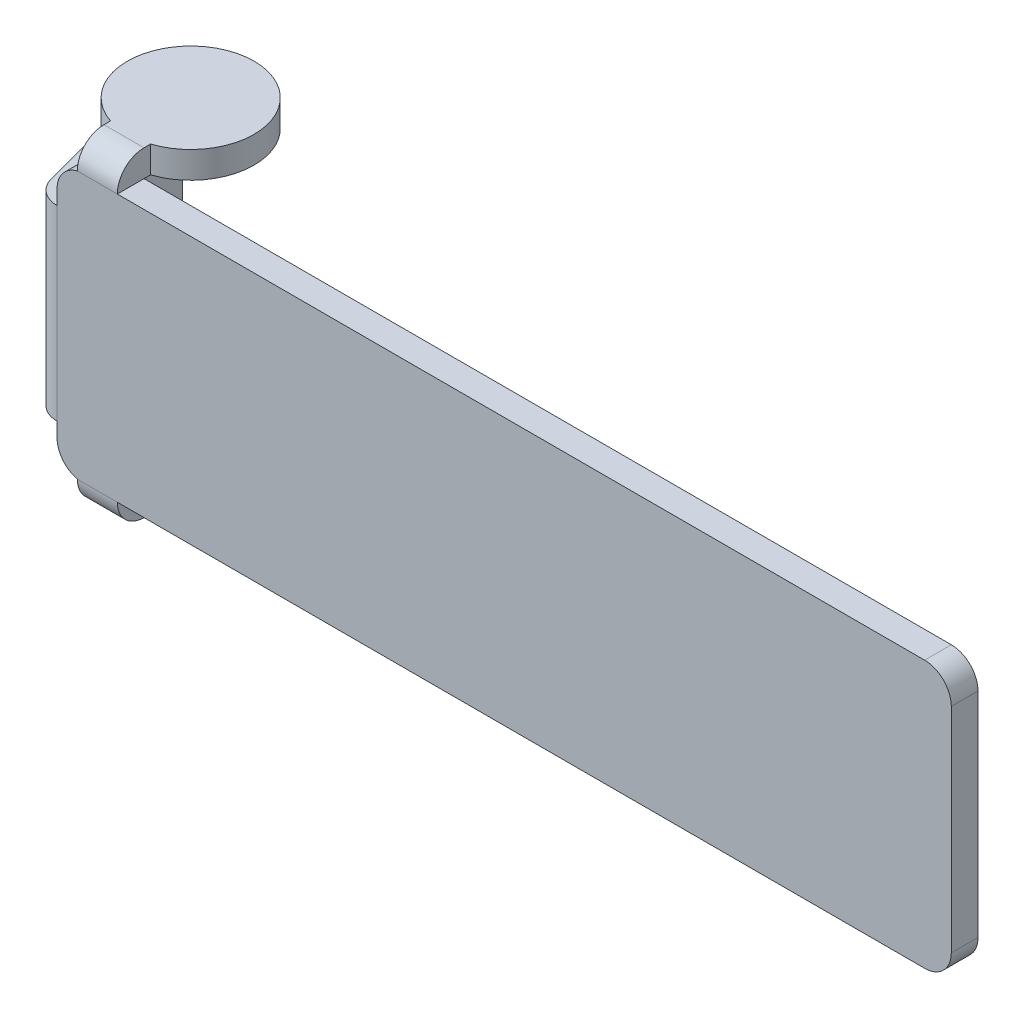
ISO-10303-21;
HEADER;
FILE_DESCRIPTION(('STEP AP214'),'2;1');
FILE_NAME('part.step','',(''),(''),'','','');
FILE_SCHEMA(('AUTOMOTIVE_DESIGN { 1 0 10303 214 1 1 1 1 }'));
ENDSEC;
DATA;
#1=APPLICATION_CONTEXT('core data for automotive mechanical design processes');
#2=APPLICATION_PROTOCOL_DEFINITION('international standard','automotive_design',2000,#1);
#3=PRODUCT_CONTEXT('',#1,'mechanical');
#4=PRODUCT('Part','Part','',(#3));
#5=PRODUCT_RELATED_PRODUCT_CATEGORY('part','',(#4));
#6=PRODUCT_DEFINITION_FORMATION('','',#4);
#7=PRODUCT_DEFINITION_CONTEXT('part definition',#1,'design');
#8=PRODUCT_DEFINITION('design','',#6,#7);
#9=PRODUCT_DEFINITION_SHAPE('','',#8);
#10=(LENGTH_UNIT() NAMED_UNIT(*) SI_UNIT(.MILLI.,.METRE.));
#11=(NAMED_UNIT(*) PLANE_ANGLE_UNIT() SI_UNIT($,.RADIAN.));
#12=(NAMED_UNIT(*) SI_UNIT($,.STERADIAN.) SOLID_ANGLE_UNIT());
#13=UNCERTAINTY_MEASURE_WITH_UNIT(LENGTH_MEASURE(1.E-05),#10,'distance_accuracy_value','');
#14=(GEOMETRIC_REPRESENTATION_CONTEXT(3) GLOBAL_UNCERTAINTY_ASSIGNED_CONTEXT((#13)) GLOBAL_UNIT_ASSIGNED_CONTEXT((#10,
#11,#12)) REPRESENTATION_CONTEXT('',''));
#15=CARTESIAN_POINT('',(0.,0.,0.));
#16=DIRECTION('',(0.,0.,1.));
#17=DIRECTION('',(1.,0.,0.));
#18=AXIS2_PLACEMENT_3D('',#15,#16,#17);
#19=CARTESIAN_POINT('',(3.5,-0.2,0.1));
#20=DIRECTION('',(0.,-1.,0.));
#21=DIRECTION('',(0.,0.,-1.));
#22=AXIS2_PLACEMENT_3D('',#19,#20,#21);
#23=PLANE('',#22);
#24=CARTESIAN_POINT('',(0.6,-0.2,-0.5));
#25=DIRECTION('',(0.,-1.,0.));
#26=DIRECTION('',(0.,0.,-1.));
#27=AXIS2_PLACEMENT_3D('',#24,#25,#26);
#28=CIRCLE('',#27,0.475);
#29=CARTESIAN_POINT('',(0.75,-0.2,-0.0493060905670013));
#30=VERTEX_POINT('',#29);
#31=CARTESIAN_POINT('',(0.45,-0.2,-0.0493060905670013));
#32=VERTEX_POINT('',#31);
#33=EDGE_CURVE('E20',#30,#32,#28,.F.);
#34=ORIENTED_EDGE('',*,*,#33,.F.);
#35=DIRECTION('',(0.,0.,-1.));
#36=VECTOR('',#35,1.);
#37=CARTESIAN_POINT('',(0.75,-0.2,0.1));
#38=LINE('',#37,#36);
#39=CARTESIAN_POINT('',(0.75,-0.2,0.));
#40=VERTEX_POINT('',#39);
#41=EDGE_CURVE('E157',#30,#40,#38,.F.);
#42=ORIENTED_EDGE('',*,*,#41,.T.);
#43=DIRECTION('',(1.,0.,0.));
#44=VECTOR('',#43,1.);
#45=CARTESIAN_POINT('',(3.5,-0.2,0.));
#46=LINE('',#45,#44);
#47=CARTESIAN_POINT('',(0.45,-0.2,0.));
#48=VERTEX_POINT('',#47);
#49=EDGE_CURVE('E152',#40,#48,#46,.F.);
#50=ORIENTED_EDGE('',*,*,#49,.T.);
#51=DIRECTION('',(0.,0.,-1.));
#52=VECTOR('',#51,1.);
#53=CARTESIAN_POINT('',(0.45,-0.2,0.1));
#54=LINE('',#53,#52);
#55=EDGE_CURVE('E150',#48,#32,#54,.T.);
#56=ORIENTED_EDGE('',*,*,#55,.T.);
#57=EDGE_LOOP('',(#34,#42,#50,#56));
#58=FACE_BOUND('',#57,.T.);
#59=ADVANCED_FACE('F17',(#58),#23,.T.);
#60=CARTESIAN_POINT('',(3.5,2.,0.1));
#61=DIRECTION('',(0.,1.,0.));
#62=DIRECTION('',(0.,0.,1.));
#63=AXIS2_PLACEMENT_3D('',#60,#61,#62);
#64=PLANE('',#63);
#65=DIRECTION('',(0.,0.,1.));
#66=VECTOR('',#65,1.);
#67=CARTESIAN_POINT('',(0.45,2.,0.1));
#68=LINE('',#67,#66);
#69=CARTESIAN_POINT('',(0.45,2.,-0.0493060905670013));
#70=VERTEX_POINT('',#69);
#71=CARTESIAN_POINT('',(0.449999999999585,2.,0.));
#72=VERTEX_POINT('',#71);
#73=EDGE_CURVE('E176',#70,#72,#68,.T.);
#74=ORIENTED_EDGE('',*,*,#73,.F.);
#75=CARTESIAN_POINT('',(0.6,2.,-0.5));
#76=DIRECTION('',(0.,1.,0.));
#77=DIRECTION('',(0.,0.,1.));
#78=AXIS2_PLACEMENT_3D('',#75,#76,#77);
#79=CIRCLE('',#78,0.475);
#80=CARTESIAN_POINT('',(0.75,2.,-0.0493060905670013));
#81=VERTEX_POINT('',#80);
#82=EDGE_CURVE('E166',#81,#70,#79,.T.);
#83=ORIENTED_EDGE('',*,*,#82,.F.);
#84=DIRECTION('',(0.,0.,1.));
#85=VECTOR('',#84,1.);
#86=CARTESIAN_POINT('',(0.75,2.,0.1));
#87=LINE('',#86,#85);
#88=CARTESIAN_POINT('',(0.75,2.,0.));
#89=VERTEX_POINT('',#88);
#90=EDGE_CURVE('E179',#89,#81,#87,.F.);
#91=ORIENTED_EDGE('',*,*,#90,.F.);
#92=DIRECTION('',(1.,0.,0.));
#93=VECTOR('',#92,1.);
#94=CARTESIAN_POINT('',(3.5,2.,0.));
#95=LINE('',#94,#93);
#96=EDGE_CURVE('E175',#72,#89,#95,.T.);
#97=ORIENTED_EDGE('',*,*,#96,.F.);
#98=EDGE_LOOP('',(#74,#83,#91,#97));
#99=FACE_BOUND('',#98,.T.);
#100=ADVANCED_FACE('F425',(#99),#64,.F.);
#101=CARTESIAN_POINT('',(0.6,0.,-0.5));
#102=DIRECTION('',(0.,-1.,0.));
#103=DIRECTION('',(0.,0.,-1.));
#104=AXIS2_PLACEMENT_3D('',#101,#102,#103);
#105=CYLINDRICAL_SURFACE('',#104,0.475);
#106=ORIENTED_EDGE('',*,*,#33,.T.);
#107=DIRECTION('',(0.,-1.,0.));
#108=VECTOR('',#107,1.);
#109=CARTESIAN_POINT('',(0.45,0.,-0.0493060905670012));
#110=LINE('',#109,#108);
#111=CARTESIAN_POINT('',(0.45,0.,-0.0493060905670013));
#112=VERTEX_POINT('',#111);
#113=EDGE_CURVE('E160',#32,#112,#110,.F.);
#114=ORIENTED_EDGE('',*,*,#113,.T.);
#115=CARTESIAN_POINT('',(0.6,0.,-0.5));
#116=DIRECTION('',(0.,-1.,0.));
#117=DIRECTION('',(0.,0.,-1.));
#118=AXIS2_PLACEMENT_3D('',#115,#116,#117);
#119=CIRCLE('',#118,0.475);
#120=CARTESIAN_POINT('',(0.75,0.,-0.0493060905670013));
#121=VERTEX_POINT('',#120);
#122=EDGE_CURVE('E244',#112,#121,#119,.T.);
#123=ORIENTED_EDGE('',*,*,#122,.T.);
#124=DIRECTION('',(0.,-1.,0.));
#125=VECTOR('',#124,1.);
#126=CARTESIAN_POINT('',(0.75,0.,-0.0493060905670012));
#127=LINE('',#126,#125);
#128=EDGE_CURVE('E144',#121,#30,#127,.T.);
#129=ORIENTED_EDGE('',*,*,#128,.T.);
#130=EDGE_LOOP('',(#106,#114,#123,#129));
#131=FACE_BOUND('',#130,.T.);
#132=ADVANCED_FACE('F159',(#131),#105,.T.);
#133=CARTESIAN_POINT('',(0.6,2.,-0.5));
#134=DIRECTION('',(0.,1.,0.));
#135=DIRECTION('',(0.,0.,1.));
#136=AXIS2_PLACEMENT_3D('',#133,#134,#135);
#137=CYLINDRICAL_SURFACE('',#136,0.475);
#138=CARTESIAN_POINT('',(0.6,2.2,-0.5));
#139=DIRECTION('',(0.,1.,0.));
#140=DIRECTION('',(0.,0.,1.));
#141=AXIS2_PLACEMENT_3D('',#138,#139,#140);
#142=CIRCLE('',#141,0.475);
#143=CARTESIAN_POINT('',(0.75,2.2,-0.0493060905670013));
#144=VERTEX_POINT('',#143);
#145=CARTESIAN_POINT('',(0.45,2.2,-0.0493060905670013));
#146=VERTEX_POINT('',#145);
#147=EDGE_CURVE('E240',#144,#146,#142,.T.);
#148=ORIENTED_EDGE('',*,*,#147,.F.);
#149=DIRECTION('',(0.,1.,0.));
#150=VECTOR('',#149,1.);
#151=CARTESIAN_POINT('',(0.75,2.,-0.0493060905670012));
#152=LINE('',#151,#150);
#153=EDGE_CURVE('E172',#144,#81,#152,.F.);
#154=ORIENTED_EDGE('',*,*,#153,.T.);
#155=ORIENTED_EDGE('',*,*,#82,.T.);
#156=DIRECTION('',(0.,1.,0.));
#157=VECTOR('',#156,1.);
#158=CARTESIAN_POINT('',(0.45,2.,-0.0493060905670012));
#159=LINE('',#158,#157);
#160=EDGE_CURVE('E169',#70,#146,#159,.T.);
#161=ORIENTED_EDGE('',*,*,#160,.T.);
#162=EDGE_LOOP('',(#148,#154,#155,#161));
#163=FACE_BOUND('',#162,.T.);
#164=ADVANCED_FACE('F257',(#163),#137,.T.);
#165=CARTESIAN_POINT('',(3.5,0.,0.1));
#166=DIRECTION('',(0.,-1.,0.));
#167=DIRECTION('',(0.,0.,-1.));
#168=AXIS2_PLACEMENT_3D('',#165,#166,#167);
#169=PLANE('',#168);
#170=DIRECTION('',(0.,0.,-1.));
#171=VECTOR('',#170,1.);
#172=CARTESIAN_POINT('',(0.75,0.,-0.049306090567));
#173=LINE('',#172,#171);
#174=CARTESIAN_POINT('',(0.75,0.,0.));
#175=VERTEX_POINT('',#174);
#176=EDGE_CURVE('E229',#121,#175,#173,.F.);
#177=ORIENTED_EDGE('',*,*,#176,.F.);
#178=ORIENTED_EDGE('',*,*,#122,.F.);
#179=DIRECTION('',(0.,0.,-1.));
#180=VECTOR('',#179,1.);
#181=CARTESIAN_POINT('',(0.45,0.,0.1));
#182=LINE('',#181,#180);
#183=CARTESIAN_POINT('',(0.449999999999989,0.,0.));
#184=VERTEX_POINT('',#183);
#185=EDGE_CURVE('E165',#184,#112,#182,.T.);
#186=ORIENTED_EDGE('',*,*,#185,.F.);
#187=DIRECTION('',(1.,0.,0.));
#188=VECTOR('',#187,1.);
#189=CARTESIAN_POINT('',(3.5,0.,0.));
#190=LINE('',#189,#188);
#191=EDGE_CURVE('E243',#175,#184,#190,.F.);
#192=ORIENTED_EDGE('',*,*,#191,.F.);
#193=EDGE_LOOP('',(#177,#178,#186,#192));
#194=FACE_BOUND('',#193,.T.);
#195=ADVANCED_FACE('F646',(#194),#169,.F.);
#196=CARTESIAN_POINT('',(3.5,2.2,0.1));
#197=DIRECTION('',(0.,1.,0.));
#198=DIRECTION('',(0.,0.,1.));
#199=AXIS2_PLACEMENT_3D('',#196,#197,#198);
#200=PLANE('',#199);
#201=ORIENTED_EDGE('',*,*,#147,.T.);
#202=DIRECTION('',(0.,0.,1.));
#203=VECTOR('',#202,1.);
#204=CARTESIAN_POINT('',(0.45,2.2,0.1));
#205=LINE('',#204,#203);
#206=CARTESIAN_POINT('',(0.45,2.2,0.));
#207=VERTEX_POINT('',#206);
#208=EDGE_CURVE('E239',#146,#207,#205,.T.);
#209=ORIENTED_EDGE('',*,*,#208,.T.);
#210=DIRECTION('',(1.,0.,0.));
#211=VECTOR('',#210,1.);
#212=CARTESIAN_POINT('',(-0.02644957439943,2.2,0.));
#213=LINE('',#212,#211);
#214=CARTESIAN_POINT('',(0.75,2.2,0.));
#215=VERTEX_POINT('',#214);
#216=EDGE_CURVE('E236',#215,#207,#213,.F.);
#217=ORIENTED_EDGE('',*,*,#216,.F.);
#218=DIRECTION('',(0.,0.,-1.));
#219=VECTOR('',#218,1.);
#220=CARTESIAN_POINT('',(0.75,2.2,0.2));
#221=LINE('',#220,#219);
#222=EDGE_CURVE('E226',#144,#215,#221,.F.);
#223=ORIENTED_EDGE('',*,*,#222,.F.);
#224=EDGE_LOOP('',(#201,#209,#217,#223));
#225=FACE_BOUND('',#224,.T.);
#226=ADVANCED_FACE('F263',(#225),#200,.T.);
#227=CARTESIAN_POINT('',(0.2980323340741,1.833704,0.));
#228=DIRECTION('',(0.,-1.,0.));
#229=DIRECTION('',(0.,0.,-1.));
#230=AXIS2_PLACEMENT_3D('',#227,#228,#229);
#231=CYLINDRICAL_SURFACE('',#230,0.2);
#232=CARTESIAN_POINT('',(0.2980323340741,1.7,0.));
#233=DIRECTION('',(0.,-1.,0.));
#234=DIRECTION('',(0.,0.,-1.));
#235=AXIS2_PLACEMENT_3D('',#232,#233,#234);
#236=CIRCLE('',#235,0.2);
#237=CARTESIAN_POINT('',(0.2980323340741,1.7,0.2));
#238=VERTEX_POINT('',#237);
#239=CARTESIAN_POINT('',(0.104847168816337,1.7,0.051763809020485));
#240=VERTEX_POINT('',#239);
#241=EDGE_CURVE('E234',#238,#240,#236,.T.);
#242=ORIENTED_EDGE('',*,*,#241,.T.);
#243=DIRECTION('',(0.,1.,0.));
#244=VECTOR('',#243,1.);
#245=CARTESIAN_POINT('',(0.104847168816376,0.,0.0517638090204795));
#246=LINE('',#245,#244);
#247=CARTESIAN_POINT('',(0.104847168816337,0.3,0.051763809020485));
#248=VERTEX_POINT('',#247);
#249=EDGE_CURVE('E233',#248,#240,#246,.T.);
#250=ORIENTED_EDGE('',*,*,#249,.F.);
#251=CARTESIAN_POINT('',(0.2980323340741,0.3,0.));
#252=DIRECTION('',(0.,-1.,0.));
#253=DIRECTION('',(0.,0.,-1.));
#254=AXIS2_PLACEMENT_3D('',#251,#252,#253);
#255=CIRCLE('',#254,0.2);
#256=CARTESIAN_POINT('',(0.2980323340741,0.3,0.2));
#257=VERTEX_POINT('',#256);
#258=EDGE_CURVE('E237',#248,#257,#255,.F.);
#259=ORIENTED_EDGE('',*,*,#258,.T.);
#260=DIRECTION('',(0.,1.,0.));
#261=VECTOR('',#260,1.);
#262=CARTESIAN_POINT('',(0.2980323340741,0.,0.2));
#263=LINE('',#262,#261);
#264=EDGE_CURVE('E310',#238,#257,#263,.F.);
#265=ORIENTED_EDGE('',*,*,#264,.F.);
#266=EDGE_LOOP('',(#242,#250,#259,#265));
#267=FACE_BOUND('',#266,.T.);
#268=ADVANCED_FACE('F630',(#267),#231,.T.);
#269=CARTESIAN_POINT('',(-0.02644957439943,2.,0.));
#270=DIRECTION('',(1.,0.,0.));
#271=DIRECTION('',(0.,0.,-1.));
#272=AXIS2_PLACEMENT_3D('',#269,#270,#271);
#273=CYLINDRICAL_SURFACE('',#272,0.2);
#274=ORIENTED_EDGE('',*,*,#216,.T.);
#275=CARTESIAN_POINT('',(0.45,2.,0.));
#276=DIRECTION('',(1.,0.,0.));
#277=DIRECTION('',(0.,0.,-1.));
#278=AXIS2_PLACEMENT_3D('',#275,#276,#277);
#279=CIRCLE('',#278,0.2);
#280=CARTESIAN_POINT('',(0.449999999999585,2.0000000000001,0.2));
#281=VERTEX_POINT('',#280);
#282=EDGE_CURVE('E214',#281,#207,#279,.F.);
#283=ORIENTED_EDGE('',*,*,#282,.F.);
#284=DIRECTION('',(1.,0.,0.));
#285=VECTOR('',#284,1.);
#286=CARTESIAN_POINT('',(0.,2.,0.2));
#287=LINE('',#286,#285);
#288=CARTESIAN_POINT('',(0.75,2.,0.2));
#289=VERTEX_POINT('',#288);
#290=EDGE_CURVE('E222',#289,#281,#287,.F.);
#291=ORIENTED_EDGE('',*,*,#290,.F.);
#292=CARTESIAN_POINT('',(0.75,2.,0.));
#293=DIRECTION('',(1.,0.,0.));
#294=DIRECTION('',(0.,0.,-1.));
#295=AXIS2_PLACEMENT_3D('',#292,#293,#294);
#296=CIRCLE('',#295,0.2);
#297=EDGE_CURVE('E227',#215,#289,#296,.T.);
#298=ORIENTED_EDGE('',*,*,#297,.F.);
#299=EDGE_LOOP('',(#274,#283,#291,#298));
#300=FACE_BOUND('',#299,.T.);
#301=ADVANCED_FACE('F274',(#300),#273,.T.);
#302=CARTESIAN_POINT('',(0.1445669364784,0.,0.2));
#303=DIRECTION('',(-0.965925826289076,0.,0.258819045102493));
#304=DIRECTION('',(0.258819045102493,0.,0.965925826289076));
#305=AXIS2_PLACEMENT_3D('',#302,#303,#304);
#306=PLANE('',#305);
#307=DIRECTION('',(0.,1.,0.));
#308=VECTOR('',#307,1.);
#309=CARTESIAN_POINT('',(-0.1657420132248,0.,-0.9580887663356));
#310=LINE('',#309,#308);
#311=CARTESIAN_POINT('',(-0.1657420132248,0.3,-0.9580887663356));
#312=VERTEX_POINT('',#311);
#313=CARTESIAN_POINT('',(-0.1657420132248,1.7,-0.9580887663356));
#314=VERTEX_POINT('',#313);
#315=EDGE_CURVE('E302',#312,#314,#310,.T.);
#316=ORIENTED_EDGE('',*,*,#315,.F.);
#317=DIRECTION('',(-0.25881904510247,0.,-0.965925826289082));
#318=VECTOR('',#317,1.);
#319=CARTESIAN_POINT('',(0.1048471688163,0.3,0.0517638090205));
#320=LINE('',#319,#318);
#321=EDGE_CURVE('E322',#248,#312,#320,.T.);
#322=ORIENTED_EDGE('',*,*,#321,.F.);
#323=ORIENTED_EDGE('',*,*,#249,.T.);
#324=DIRECTION('',(-0.25881904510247,0.,-0.965925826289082));
#325=VECTOR('',#324,1.);
#326=CARTESIAN_POINT('',(0.1048471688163,1.7,0.0517638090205));
#327=LINE('',#326,#325);
#328=EDGE_CURVE('E217',#240,#314,#327,.T.);
#329=ORIENTED_EDGE('',*,*,#328,.T.);
#330=EDGE_LOOP('',(#316,#322,#323,#329));
#331=FACE_BOUND('',#330,.T.);
#332=ADVANCED_FACE('F613',(#331),#306,.T.);
#333=CARTESIAN_POINT('',(1.226449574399,0.,0.));
#334=DIRECTION('',(-1.,0.,0.));
#335=DIRECTION('',(0.,0.,1.));
#336=AXIS2_PLACEMENT_3D('',#333,#334,#335);
#337=CYLINDRICAL_SURFACE('',#336,0.2);
#338=CARTESIAN_POINT('',(0.75,0.,0.));
#339=DIRECTION('',(-1.,0.,0.));
#340=DIRECTION('',(0.,0.,1.));
#341=AXIS2_PLACEMENT_3D('',#338,#339,#340);
#342=CIRCLE('',#341,0.2);
#343=CARTESIAN_POINT('',(0.75,0.,0.2));
#344=VERTEX_POINT('',#343);
#345=EDGE_CURVE('E230',#344,#40,#342,.F.);
#346=ORIENTED_EDGE('',*,*,#345,.F.);
#347=DIRECTION('',(1.,0.,0.));
#348=VECTOR('',#347,1.);
#349=CARTESIAN_POINT('',(0.,0.,0.2));
#350=LINE('',#349,#348);
#351=CARTESIAN_POINT('',(0.44999999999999,0.,0.2));
#352=VERTEX_POINT('',#351);
#353=EDGE_CURVE('E225',#352,#344,#350,.T.);
#354=ORIENTED_EDGE('',*,*,#353,.F.);
#355=CARTESIAN_POINT('',(0.45,0.,0.));
#356=DIRECTION('',(-1.,0.,0.));
#357=DIRECTION('',(0.,0.,1.));
#358=AXIS2_PLACEMENT_3D('',#355,#356,#357);
#359=CIRCLE('',#358,0.2);
#360=EDGE_CURVE('E210',#48,#352,#359,.T.);
#361=ORIENTED_EDGE('',*,*,#360,.F.);
#362=ORIENTED_EDGE('',*,*,#49,.F.);
#363=EDGE_LOOP('',(#346,#354,#361,#362));
#364=FACE_BOUND('',#363,.T.);
#365=ADVANCED_FACE('F441',(#364),#337,.T.);
#366=CARTESIAN_POINT('',(0.75,0.,-0.049306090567));
#367=DIRECTION('',(1.,0.,0.));
#368=DIRECTION('',(0.,0.,-1.));
#369=AXIS2_PLACEMENT_3D('',#366,#367,#368);
#370=PLANE('',#369);
#371=ORIENTED_EDGE('',*,*,#176,.T.);
#372=DIRECTION('',(0.,0.,-1.));
#373=VECTOR('',#372,1.);
#374=CARTESIAN_POINT('',(0.75,0.,0.));
#375=LINE('',#374,#373);
#376=EDGE_CURVE('E212',#344,#175,#375,.T.);
#377=ORIENTED_EDGE('',*,*,#376,.F.);
#378=ORIENTED_EDGE('',*,*,#345,.T.);
#379=ORIENTED_EDGE('',*,*,#41,.F.);
#380=ORIENTED_EDGE('',*,*,#128,.F.);
#381=EDGE_LOOP('',(#371,#377,#378,#379,#380));
#382=FACE_BOUND('',#381,.T.);
#383=ADVANCED_FACE('F433',(#382),#370,.T.);
#384=CARTESIAN_POINT('',(0.75,2.,0.2));
#385=DIRECTION('',(1.,0.,0.));
#386=DIRECTION('',(0.,0.,-1.));
#387=AXIS2_PLACEMENT_3D('',#384,#385,#386);
#388=PLANE('',#387);
#389=ORIENTED_EDGE('',*,*,#153,.F.);
#390=ORIENTED_EDGE('',*,*,#222,.T.);
#391=ORIENTED_EDGE('',*,*,#297,.T.);
#392=DIRECTION('',(0.,0.,1.));
#393=VECTOR('',#392,1.);
#394=CARTESIAN_POINT('',(0.75,2.,0.));
#395=LINE('',#394,#393);
#396=EDGE_CURVE('E317',#89,#289,#395,.T.);
#397=ORIENTED_EDGE('',*,*,#396,.F.);
#398=ORIENTED_EDGE('',*,*,#90,.T.);
#399=EDGE_LOOP('',(#389,#390,#391,#397,#398));
#400=FACE_BOUND('',#399,.T.);
#401=ADVANCED_FACE('F431',(#400),#388,.T.);
#402=CARTESIAN_POINT('',(0.,0.,0.2));
#403=DIRECTION('',(0.,0.,1.));
#404=DIRECTION('',(1.,0.,0.));
#405=AXIS2_PLACEMENT_3D('',#402,#403,#404);
#406=PLANE('',#405);
#407=ORIENTED_EDGE('',*,*,#264,.T.);
#408=DIRECTION('',(0.,1.,0.));
#409=VECTOR('',#408,1.);
#410=CARTESIAN_POINT('',(0.2980323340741,0.,0.2));
#411=LINE('',#410,#409);
#412=CARTESIAN_POINT('',(0.2980323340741,0.1941465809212,0.2));
#413=VERTEX_POINT('',#412);
#414=EDGE_CURVE('E218',#257,#413,#411,.F.);
#415=ORIENTED_EDGE('',*,*,#414,.T.);
#416=CARTESIAN_POINT('',(0.4980323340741,0.1941465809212,0.2));
#417=DIRECTION('',(0.,0.,-1.));
#418=DIRECTION('',(-1.,0.,0.));
#419=AXIS2_PLACEMENT_3D('',#416,#417,#418);
#420=CIRCLE('',#419,0.2);
#421=EDGE_CURVE('E223',#413,#352,#420,.F.);
#422=ORIENTED_EDGE('',*,*,#421,.T.);
#423=ORIENTED_EDGE('',*,*,#353,.T.);
#424=DIRECTION('',(1.,0.,0.));
#425=VECTOR('',#424,1.);
#426=CARTESIAN_POINT('',(0.,0.,0.2));
#427=LINE('',#426,#425);
#428=CARTESIAN_POINT('',(6.8,0.,0.2));
#429=VERTEX_POINT('',#428);
#430=EDGE_CURVE('E209',#429,#344,#427,.F.);
#431=ORIENTED_EDGE('',*,*,#430,.F.);
#432=CARTESIAN_POINT('',(6.8,0.2,0.2));
#433=DIRECTION('',(0.,0.,-1.));
#434=DIRECTION('',(-1.,0.,0.));
#435=AXIS2_PLACEMENT_3D('',#432,#433,#434);
#436=CIRCLE('',#435,0.2);
#437=CARTESIAN_POINT('',(7.,0.2,0.2));
#438=VERTEX_POINT('',#437);
#439=EDGE_CURVE('E206',#438,#429,#436,.T.);
#440=ORIENTED_EDGE('',*,*,#439,.F.);
#441=DIRECTION('',(0.,1.,0.));
#442=VECTOR('',#441,1.);
#443=CARTESIAN_POINT('',(7.,0.,0.2));
#444=LINE('',#443,#442);
#445=CARTESIAN_POINT('',(7.,1.8,0.2));
#446=VERTEX_POINT('',#445);
#447=EDGE_CURVE('E294',#446,#438,#444,.F.);
#448=ORIENTED_EDGE('',*,*,#447,.F.);
#449=CARTESIAN_POINT('',(6.8,1.8,0.2));
#450=DIRECTION('',(0.,0.,-1.));
#451=DIRECTION('',(-1.,0.,0.));
#452=AXIS2_PLACEMENT_3D('',#449,#450,#451);
#453=CIRCLE('',#452,0.2);
#454=CARTESIAN_POINT('',(6.8,2.,0.2));
#455=VERTEX_POINT('',#454);
#456=EDGE_CURVE('E202',#455,#446,#453,.T.);
#457=ORIENTED_EDGE('',*,*,#456,.F.);
#458=DIRECTION('',(1.,0.,0.));
#459=VECTOR('',#458,1.);
#460=CARTESIAN_POINT('',(7.,2.,0.2));
#461=LINE('',#460,#459);
#462=EDGE_CURVE('E287',#289,#455,#461,.T.);
#463=ORIENTED_EDGE('',*,*,#462,.F.);
#464=ORIENTED_EDGE('',*,*,#290,.T.);
#465=CARTESIAN_POINT('',(0.4980323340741,1.805853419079,0.2));
#466=DIRECTION('',(0.,0.,1.));
#467=DIRECTION('',(1.,0.,0.));
#468=AXIS2_PLACEMENT_3D('',#465,#466,#467);
#469=CIRCLE('',#468,0.2);
#470=CARTESIAN_POINT('',(0.2980323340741,1.805853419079,0.2));
#471=VERTEX_POINT('',#470);
#472=EDGE_CURVE('E219',#281,#471,#469,.T.);
#473=ORIENTED_EDGE('',*,*,#472,.T.);
#474=DIRECTION('',(0.,1.,0.));
#475=VECTOR('',#474,1.);
#476=CARTESIAN_POINT('',(0.2980323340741,0.,0.2));
#477=LINE('',#476,#475);
#478=EDGE_CURVE('E221',#471,#238,#477,.F.);
#479=ORIENTED_EDGE('',*,*,#478,.T.);
#480=EDGE_LOOP('',(#407,#415,#422,#423,#431,#440,#448,#457,#463,#464,#473,#479));
#481=FACE_BOUND('',#480,.T.);
#482=ADVANCED_FACE('F284',(#481),#406,.T.);
#483=CARTESIAN_POINT('',(0.45,2.,-0.049306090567));
#484=DIRECTION('',(-1.,0.,0.));
#485=DIRECTION('',(0.,0.,1.));
#486=AXIS2_PLACEMENT_3D('',#483,#484,#485);
#487=PLANE('',#486);
#488=ORIENTED_EDGE('',*,*,#160,.F.);
#489=ORIENTED_EDGE('',*,*,#73,.T.);
#490=DIRECTION('',(0.,0.,1.));
#491=VECTOR('',#490,1.);
#492=CARTESIAN_POINT('',(0.449999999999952,2.00000000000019,-0.0020131));
#493=LINE('',#492,#491);
#494=EDGE_CURVE('E270',#281,#72,#493,.F.);
#495=ORIENTED_EDGE('',*,*,#494,.F.);
#496=ORIENTED_EDGE('',*,*,#282,.T.);
#497=ORIENTED_EDGE('',*,*,#208,.F.);
#498=EDGE_LOOP('',(#488,#489,#495,#496,#497));
#499=FACE_BOUND('',#498,.T.);
#500=ADVANCED_FACE('F266',(#499),#487,.T.);
#501=CARTESIAN_POINT('',(3.5,1.7,0.1));
#502=DIRECTION('',(0.,-1.,0.));
#503=DIRECTION('',(0.,0.,-1.));
#504=AXIS2_PLACEMENT_3D('',#501,#502,#503);
#505=PLANE('',#504);
#506=DIRECTION('',(0.,0.,-1.));
#507=VECTOR('',#506,1.);
#508=CARTESIAN_POINT('',(0.2980323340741,1.7,0.2));
#509=LINE('',#508,#507);
#510=CARTESIAN_POINT('',(0.2980323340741,1.7,0.));
#511=VERTEX_POINT('',#510);
#512=EDGE_CURVE('E355',#238,#511,#509,.T.);
#513=ORIENTED_EDGE('',*,*,#512,.T.);
#514=DIRECTION('',(-0.258819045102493,0.,-0.965925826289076));
#515=VECTOR('',#514,1.);
#516=CARTESIAN_POINT('',(0.027443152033,1.7,-1.009852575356));
#517=LINE('',#516,#515);
#518=CARTESIAN_POINT('',(0.0274431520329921,1.7,-1.00985257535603));
#519=VERTEX_POINT('',#518);
#520=EDGE_CURVE('E361',#519,#511,#517,.F.);
#521=ORIENTED_EDGE('',*,*,#520,.F.);
#522=DIRECTION('',(-0.965925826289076,0.,0.258819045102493));
#523=VECTOR('',#522,1.);
#524=CARTESIAN_POINT('',(-0.1657420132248,1.7,-0.9580887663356));
#525=LINE('',#524,#523);
#526=EDGE_CURVE('E305',#314,#519,#525,.F.);
#527=ORIENTED_EDGE('',*,*,#526,.F.);
#528=ORIENTED_EDGE('',*,*,#328,.F.);
#529=ORIENTED_EDGE('',*,*,#241,.F.);
#530=EDGE_LOOP('',(#513,#521,#527,#528,#529));
#531=FACE_BOUND('',#530,.T.);
#532=ADVANCED_FACE('F416',(#531),#505,.F.);
#533=CARTESIAN_POINT('',(-0.1657420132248,0.,-0.9580887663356));
#534=DIRECTION('',(-0.258819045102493,0.,-0.965925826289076));
#535=DIRECTION('',(-0.965925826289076,0.,0.258819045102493));
#536=AXIS2_PLACEMENT_3D('',#533,#534,#535);
#537=PLANE('',#536);
#538=ORIENTED_EDGE('',*,*,#526,.T.);
#539=DIRECTION('',(0.,1.,0.));
#540=VECTOR('',#539,1.);
#541=CARTESIAN_POINT('',(0.027443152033,0.,-1.009852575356));
#542=LINE('',#541,#540);
#543=CARTESIAN_POINT('',(0.027443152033,0.3,-1.009852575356));
#544=VERTEX_POINT('',#543);
#545=EDGE_CURVE('E329',#544,#519,#542,.T.);
#546=ORIENTED_EDGE('',*,*,#545,.F.);
#547=DIRECTION('',(0.965925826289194,0.,-0.258819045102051));
#548=VECTOR('',#547,1.);
#549=CARTESIAN_POINT('',(-0.1657420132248,0.3,-0.9580887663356));
#550=LINE('',#549,#548);
#551=EDGE_CURVE('E213',#312,#544,#550,.T.);
#552=ORIENTED_EDGE('',*,*,#551,.F.);
#553=ORIENTED_EDGE('',*,*,#315,.T.);
#554=EDGE_LOOP('',(#538,#546,#552,#553));
#555=FACE_BOUND('',#554,.T.);
#556=ADVANCED_FACE('F483',(#555),#537,.T.);
#557=CARTESIAN_POINT('',(3.5,0.3,0.1));
#558=DIRECTION('',(0.,-1.,0.));
#559=DIRECTION('',(0.,0.,-1.));
#560=AXIS2_PLACEMENT_3D('',#557,#558,#559);
#561=PLANE('',#560);
#562=DIRECTION('',(-0.258819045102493,0.,-0.965925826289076));
#563=VECTOR('',#562,1.);
#564=CARTESIAN_POINT('',(0.027443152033,0.3,-1.009852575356));
#565=LINE('',#564,#563);
#566=CARTESIAN_POINT('',(0.2980323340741,0.3,0.));
#567=VERTEX_POINT('',#566);
#568=EDGE_CURVE('E333',#567,#544,#565,.T.);
#569=ORIENTED_EDGE('',*,*,#568,.F.);
#570=DIRECTION('',(0.,0.,-1.));
#571=VECTOR('',#570,1.);
#572=CARTESIAN_POINT('',(0.2980323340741,0.3,0.));
#573=LINE('',#572,#571);
#574=EDGE_CURVE('E332',#567,#257,#573,.F.);
#575=ORIENTED_EDGE('',*,*,#574,.T.);
#576=ORIENTED_EDGE('',*,*,#258,.F.);
#577=ORIENTED_EDGE('',*,*,#321,.T.);
#578=ORIENTED_EDGE('',*,*,#551,.T.);
#579=EDGE_LOOP('',(#569,#575,#576,#577,#578));
#580=FACE_BOUND('',#579,.T.);
#581=ADVANCED_FACE('F480',(#580),#561,.T.);
#582=CARTESIAN_POINT('',(0.45,0.,0.2));
#583=DIRECTION('',(-1.,0.,0.));
#584=DIRECTION('',(0.,0.,1.));
#585=AXIS2_PLACEMENT_3D('',#582,#583,#584);
#586=PLANE('',#585);
#587=ORIENTED_EDGE('',*,*,#55,.F.);
#588=ORIENTED_EDGE('',*,*,#360,.T.);
#589=DIRECTION('',(0.,0.,-1.));
#590=VECTOR('',#589,1.);
#591=CARTESIAN_POINT('',(0.449999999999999,0.,0.2019869));
#592=LINE('',#591,#590);
#593=EDGE_CURVE('E378',#184,#352,#592,.F.);
#594=ORIENTED_EDGE('',*,*,#593,.F.);
#595=ORIENTED_EDGE('',*,*,#185,.T.);
#596=ORIENTED_EDGE('',*,*,#113,.F.);
#597=EDGE_LOOP('',(#587,#588,#594,#595,#596));
#598=FACE_BOUND('',#597,.T.);
#599=ADVANCED_FACE('F163',(#598),#586,.T.);
#600=CARTESIAN_POINT('',(0.,0.,0.));
#601=DIRECTION('',(0.,-1.,0.));
#602=DIRECTION('',(0.,0.,-1.));
#603=AXIS2_PLACEMENT_3D('',#600,#601,#602);
#604=PLANE('',#603);
#605=DIRECTION('',(0.,0.,-1.));
#606=VECTOR('',#605,1.);
#607=CARTESIAN_POINT('',(6.8,0.,0.35648));
#608=LINE('',#607,#606);
#609=CARTESIAN_POINT('',(6.8,0.,0.));
#610=VERTEX_POINT('',#609);
#611=EDGE_CURVE('E208',#429,#610,#608,.T.);
#612=ORIENTED_EDGE('',*,*,#611,.F.);
#613=ORIENTED_EDGE('',*,*,#430,.T.);
#614=ORIENTED_EDGE('',*,*,#376,.T.);
#615=DIRECTION('',(1.,0.,0.));
#616=VECTOR('',#615,1.);
#617=CARTESIAN_POINT('',(0.,0.,0.));
#618=LINE('',#617,#616);
#619=EDGE_CURVE('E201',#175,#610,#618,.T.);
#620=ORIENTED_EDGE('',*,*,#619,.T.);
#621=EDGE_LOOP('',(#612,#613,#614,#620));
#622=FACE_BOUND('',#621,.T.);
#623=ADVANCED_FACE('F473',(#622),#604,.T.);
#624=CARTESIAN_POINT('',(6.8,0.2,0.35648));
#625=DIRECTION('',(0.,0.,-1.));
#626=DIRECTION('',(-1.,0.,0.));
#627=AXIS2_PLACEMENT_3D('',#624,#625,#626);
#628=CYLINDRICAL_SURFACE('',#627,0.2);
#629=ORIENTED_EDGE('',*,*,#439,.T.);
#630=ORIENTED_EDGE('',*,*,#611,.T.);
#631=CARTESIAN_POINT('',(6.8,0.2,0.));
#632=DIRECTION('',(0.,0.,-1.));
#633=DIRECTION('',(-1.,0.,0.));
#634=AXIS2_PLACEMENT_3D('',#631,#632,#633);
#635=CIRCLE('',#634,0.2);
#636=CARTESIAN_POINT('',(7.,0.2,0.));
#637=VERTEX_POINT('',#636);
#638=EDGE_CURVE('E198',#610,#637,#635,.F.);
#639=ORIENTED_EDGE('',*,*,#638,.T.);
#640=DIRECTION('',(0.,0.,-1.));
#641=VECTOR('',#640,1.);
#642=CARTESIAN_POINT('',(7.,0.2,0.));
#643=LINE('',#642,#641);
#644=EDGE_CURVE('E205',#438,#637,#643,.T.);
#645=ORIENTED_EDGE('',*,*,#644,.F.);
#646=EDGE_LOOP('',(#629,#630,#639,#645));
#647=FACE_BOUND('',#646,.T.);
#648=ADVANCED_FACE('F469',(#647),#628,.T.);
#649=CARTESIAN_POINT('',(7.,0.,0.));
#650=DIRECTION('',(1.,0.,0.));
#651=DIRECTION('',(0.,0.,-1.));
#652=AXIS2_PLACEMENT_3D('',#649,#650,#651);
#653=PLANE('',#652);
#654=ORIENTED_EDGE('',*,*,#644,.T.);
#655=DIRECTION('',(0.,1.,0.));
#656=VECTOR('',#655,1.);
#657=CARTESIAN_POINT('',(7.,0.,0.));
#658=LINE('',#657,#656);
#659=CARTESIAN_POINT('',(7.,1.8,0.));
#660=VERTEX_POINT('',#659);
#661=EDGE_CURVE('E197',#637,#660,#658,.T.);
#662=ORIENTED_EDGE('',*,*,#661,.T.);
#663=DIRECTION('',(0.,0.,-1.));
#664=VECTOR('',#663,1.);
#665=CARTESIAN_POINT('',(7.,1.8,0.35648));
#666=LINE('',#665,#664);
#667=EDGE_CURVE('E204',#446,#660,#666,.T.);
#668=ORIENTED_EDGE('',*,*,#667,.F.);
#669=ORIENTED_EDGE('',*,*,#447,.T.);
#670=EDGE_LOOP('',(#654,#662,#668,#669));
#671=FACE_BOUND('',#670,.T.);
#672=ADVANCED_FACE('F465',(#671),#653,.T.);
#673=CARTESIAN_POINT('',(6.8,1.8,0.35648));
#674=DIRECTION('',(0.,0.,-1.));
#675=DIRECTION('',(-1.,0.,0.));
#676=AXIS2_PLACEMENT_3D('',#673,#674,#675);
#677=CYLINDRICAL_SURFACE('',#676,0.2);
#678=ORIENTED_EDGE('',*,*,#456,.T.);
#679=ORIENTED_EDGE('',*,*,#667,.T.);
#680=CARTESIAN_POINT('',(6.8,1.8,0.));
#681=DIRECTION('',(0.,0.,-1.));
#682=DIRECTION('',(-1.,0.,0.));
#683=AXIS2_PLACEMENT_3D('',#680,#681,#682);
#684=CIRCLE('',#683,0.2);
#685=CARTESIAN_POINT('',(6.8,2.,0.));
#686=VERTEX_POINT('',#685);
#687=EDGE_CURVE('E194',#660,#686,#684,.F.);
#688=ORIENTED_EDGE('',*,*,#687,.T.);
#689=DIRECTION('',(0.,0.,1.));
#690=VECTOR('',#689,1.);
#691=CARTESIAN_POINT('',(6.8,2.,0.));
#692=LINE('',#691,#690);
#693=EDGE_CURVE('E316',#455,#686,#692,.F.);
#694=ORIENTED_EDGE('',*,*,#693,.F.);
#695=EDGE_LOOP('',(#678,#679,#688,#694));
#696=FACE_BOUND('',#695,.T.);
#697=ADVANCED_FACE('F462',(#696),#677,.T.);
#698=CARTESIAN_POINT('',(7.,2.,0.));
#699=DIRECTION('',(0.,1.,0.));
#700=DIRECTION('',(0.,0.,1.));
#701=AXIS2_PLACEMENT_3D('',#698,#699,#700);
#702=PLANE('',#701);
#703=ORIENTED_EDGE('',*,*,#693,.T.);
#704=DIRECTION('',(1.,0.,0.));
#705=VECTOR('',#704,1.);
#706=CARTESIAN_POINT('',(0.,2.,0.));
#707=LINE('',#706,#705);
#708=EDGE_CURVE('E193',#686,#89,#707,.F.);
#709=ORIENTED_EDGE('',*,*,#708,.T.);
#710=ORIENTED_EDGE('',*,*,#396,.T.);
#711=ORIENTED_EDGE('',*,*,#462,.T.);
#712=EDGE_LOOP('',(#703,#709,#710,#711));
#713=FACE_BOUND('',#712,.T.);
#714=ADVANCED_FACE('F429',(#713),#702,.T.);
#715=CARTESIAN_POINT('',(0.4980323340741,1.805853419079,-0.0020131));
#716=DIRECTION('',(0.,0.,1.));
#717=DIRECTION('',(1.,0.,0.));
#718=AXIS2_PLACEMENT_3D('',#715,#716,#717);
#719=CYLINDRICAL_SURFACE('',#718,0.2);
#720=CARTESIAN_POINT('',(0.4980323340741,1.805853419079,0.));
#721=DIRECTION('',(0.,0.,1.));
#722=DIRECTION('',(1.,0.,0.));
#723=AXIS2_PLACEMENT_3D('',#720,#721,#722);
#724=CIRCLE('',#723,0.2);
#725=CARTESIAN_POINT('',(0.2980323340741,1.805853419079,0.));
#726=VERTEX_POINT('',#725);
#727=EDGE_CURVE('E189',#72,#726,#724,.T.);
#728=ORIENTED_EDGE('',*,*,#727,.T.);
#729=DIRECTION('',(0.,0.,-1.));
#730=VECTOR('',#729,1.);
#731=CARTESIAN_POINT('',(0.2980323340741,1.805853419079,0.2));
#732=LINE('',#731,#730);
#733=EDGE_CURVE('E280',#726,#471,#732,.F.);
#734=ORIENTED_EDGE('',*,*,#733,.T.);
#735=ORIENTED_EDGE('',*,*,#472,.F.);
#736=ORIENTED_EDGE('',*,*,#494,.T.);
#737=EDGE_LOOP('',(#728,#734,#735,#736));
#738=FACE_BOUND('',#737,.T.);
#739=ADVANCED_FACE('F279',(#738),#719,.T.);
#740=CARTESIAN_POINT('',(0.2980323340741,2.,0.2));
#741=DIRECTION('',(1.,0.,0.));
#742=DIRECTION('',(0.,0.,-1.));
#743=AXIS2_PLACEMENT_3D('',#740,#741,#742);
#744=PLANE('',#743);
#745=DIRECTION('',(0.,1.,0.));
#746=VECTOR('',#745,1.);
#747=CARTESIAN_POINT('',(0.2980323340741,0.,0.));
#748=LINE('',#747,#746);
#749=EDGE_CURVE('E192',#726,#511,#748,.F.);
#750=ORIENTED_EDGE('',*,*,#749,.T.);
#751=ORIENTED_EDGE('',*,*,#512,.F.);
#752=ORIENTED_EDGE('',*,*,#478,.F.);
#753=ORIENTED_EDGE('',*,*,#733,.F.);
#754=EDGE_LOOP('',(#750,#751,#752,#753));
#755=FACE_BOUND('',#754,.T.);
#756=ADVANCED_FACE('F419',(#755),#744,.F.);
#757=CARTESIAN_POINT('',(0.027443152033,0.,-1.009852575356));
#758=DIRECTION('',(0.965925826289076,0.,-0.258819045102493));
#759=DIRECTION('',(-0.258819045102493,0.,-0.965925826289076));
#760=AXIS2_PLACEMENT_3D('',#757,#758,#759);
#761=PLANE('',#760);
#762=ORIENTED_EDGE('',*,*,#568,.T.);
#763=ORIENTED_EDGE('',*,*,#545,.T.);
#764=ORIENTED_EDGE('',*,*,#520,.T.);
#765=DIRECTION('',(0.,1.,0.));
#766=VECTOR('',#765,1.);
#767=CARTESIAN_POINT('',(0.2980323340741,0.,0.));
#768=LINE('',#767,#766);
#769=EDGE_CURVE('E372',#511,#567,#768,.F.);
#770=ORIENTED_EDGE('',*,*,#769,.T.);
#771=EDGE_LOOP('',(#762,#763,#764,#770));
#772=FACE_BOUND('',#771,.T.);
#773=ADVANCED_FACE('F408',(#772),#761,.T.);
#774=CARTESIAN_POINT('',(0.2980323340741,0.,0.));
#775=DIRECTION('',(1.,0.,0.));
#776=DIRECTION('',(0.,0.,-1.));
#777=AXIS2_PLACEMENT_3D('',#774,#775,#776);
#778=PLANE('',#777);
#779=ORIENTED_EDGE('',*,*,#414,.F.);
#780=ORIENTED_EDGE('',*,*,#574,.F.);
#781=DIRECTION('',(0.,1.,0.));
#782=VECTOR('',#781,1.);
#783=CARTESIAN_POINT('',(0.2980323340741,0.,0.));
#784=LINE('',#783,#782);
#785=CARTESIAN_POINT('',(0.2980323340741,0.1941465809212,0.));
#786=VERTEX_POINT('',#785);
#787=EDGE_CURVE('E26',#567,#786,#784,.F.);
#788=ORIENTED_EDGE('',*,*,#787,.T.);
#789=DIRECTION('',(0.,0.,-1.));
#790=VECTOR('',#789,1.);
#791=CARTESIAN_POINT('',(0.2980323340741,0.1941465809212,0.2019869));
#792=LINE('',#791,#790);
#793=EDGE_CURVE('E34',#413,#786,#792,.T.);
#794=ORIENTED_EDGE('',*,*,#793,.F.);
#795=EDGE_LOOP('',(#779,#780,#788,#794));
#796=FACE_BOUND('',#795,.T.);
#797=ADVANCED_FACE('F401',(#796),#778,.F.);
#798=CARTESIAN_POINT('',(0.4980323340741,0.1941465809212,0.2019869));
#799=DIRECTION('',(0.,0.,-1.));
#800=DIRECTION('',(-1.,0.,0.));
#801=AXIS2_PLACEMENT_3D('',#798,#799,#800);
#802=CYLINDRICAL_SURFACE('',#801,0.2);
#803=ORIENTED_EDGE('',*,*,#421,.F.);
#804=ORIENTED_EDGE('',*,*,#793,.T.);
#805=CARTESIAN_POINT('',(0.4980323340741,0.1941465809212,0.));
#806=DIRECTION('',(0.,0.,-1.));
#807=DIRECTION('',(-1.,0.,0.));
#808=AXIS2_PLACEMENT_3D('',#805,#806,#807);
#809=CIRCLE('',#808,0.2);
#810=EDGE_CURVE('E11',#786,#184,#809,.F.);
#811=ORIENTED_EDGE('',*,*,#810,.T.);
#812=ORIENTED_EDGE('',*,*,#593,.T.);
#813=EDGE_LOOP('',(#803,#804,#811,#812));
#814=FACE_BOUND('',#813,.T.);
#815=ADVANCED_FACE('F445',(#814),#802,.T.);
#816=CARTESIAN_POINT('',(0.,0.,0.));
#817=DIRECTION('',(0.,0.,1.));
#818=DIRECTION('',(1.,0.,0.));
#819=AXIS2_PLACEMENT_3D('',#816,#817,#818);
#820=PLANE('',#819);
#821=ORIENTED_EDGE('',*,*,#787,.F.);
#822=ORIENTED_EDGE('',*,*,#769,.F.);
#823=ORIENTED_EDGE('',*,*,#749,.F.);
#824=ORIENTED_EDGE('',*,*,#727,.F.);
#825=ORIENTED_EDGE('',*,*,#96,.T.);
#826=ORIENTED_EDGE('',*,*,#708,.F.);
#827=ORIENTED_EDGE('',*,*,#687,.F.);
#828=ORIENTED_EDGE('',*,*,#661,.F.);
#829=ORIENTED_EDGE('',*,*,#638,.F.);
#830=ORIENTED_EDGE('',*,*,#619,.F.);
#831=ORIENTED_EDGE('',*,*,#191,.T.);
#832=ORIENTED_EDGE('',*,*,#810,.F.);
#833=EDGE_LOOP('',(#821,#822,#823,#824,#825,#826,#827,#828,#829,#830,#831,#832));
#834=FACE_BOUND('',#833,.T.);
#835=ADVANCED_FACE('F405',(#834),#820,.F.);
#836=CLOSED_SHELL('',(#59,#100,#132,#164,#195,#226,#268,#301,#332,#365,#383,#401,#482,#500,#532,
#556,#581,#599,#623,#648,#672,#697,#714,#739,#756,#773,#797,#815,#835));
#837=MANIFOLD_SOLID_BREP('B1',#836);
#838=ADVANCED_BREP_SHAPE_REPRESENTATION('',(#18,#837),#14);
#839=SHAPE_DEFINITION_REPRESENTATION(#9,#838);
ENDSEC;
END-ISO-10303-21;
